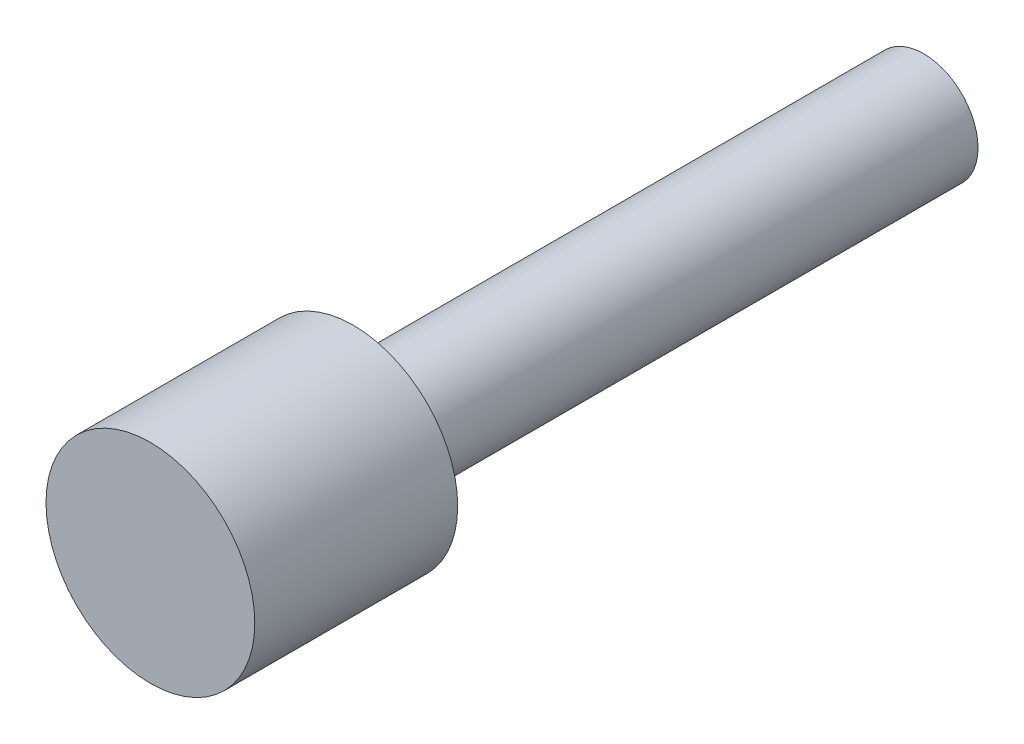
ISO-10303-21;
HEADER;
FILE_DESCRIPTION(('STEP AP214'),'2;1');
FILE_NAME('part.step','',(''),(''),'','','');
FILE_SCHEMA(('AUTOMOTIVE_DESIGN { 1 0 10303 214 1 1 1 1 }'));
ENDSEC;
DATA;
#1=APPLICATION_CONTEXT('core data for automotive mechanical design processes');
#2=APPLICATION_PROTOCOL_DEFINITION('international standard','automotive_design',2000,#1);
#3=PRODUCT_CONTEXT('',#1,'mechanical');
#4=PRODUCT('Part','Part','',(#3));
#5=PRODUCT_RELATED_PRODUCT_CATEGORY('part','',(#4));
#6=PRODUCT_DEFINITION_FORMATION('','',#4);
#7=PRODUCT_DEFINITION_CONTEXT('part definition',#1,'design');
#8=PRODUCT_DEFINITION('design','',#6,#7);
#9=PRODUCT_DEFINITION_SHAPE('','',#8);
#10=(LENGTH_UNIT() NAMED_UNIT(*) SI_UNIT(.MILLI.,.METRE.));
#11=(NAMED_UNIT(*) PLANE_ANGLE_UNIT() SI_UNIT($,.RADIAN.));
#12=(NAMED_UNIT(*) SI_UNIT($,.STERADIAN.) SOLID_ANGLE_UNIT());
#13=UNCERTAINTY_MEASURE_WITH_UNIT(LENGTH_MEASURE(1.E-05),#10,'distance_accuracy_value','');
#14=(GEOMETRIC_REPRESENTATION_CONTEXT(3) GLOBAL_UNCERTAINTY_ASSIGNED_CONTEXT((#13)) GLOBAL_UNIT_ASSIGNED_CONTEXT((#10,
#11,#12)) REPRESENTATION_CONTEXT('',''));
#15=CARTESIAN_POINT('',(0.,0.,0.));
#16=DIRECTION('',(0.,0.,1.));
#17=DIRECTION('',(1.,0.,0.));
#18=AXIS2_PLACEMENT_3D('',#15,#16,#17);
#19=CARTESIAN_POINT('',(0.,0.,-8.33119862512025));
#20=DIRECTION('',(0.,0.,1.));
#21=DIRECTION('',(1.,0.,0.));
#22=AXIS2_PLACEMENT_3D('',#19,#20,#21);
#23=CYLINDRICAL_SURFACE('',#22,4.28625);
#24=CARTESIAN_POINT('',(0.,0.,-8.33119862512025));
#25=DIRECTION('',(0.,0.,1.));
#26=DIRECTION('',(1.,0.,0.));
#27=AXIS2_PLACEMENT_3D('',#24,#25,#26);
#28=CIRCLE('',#27,4.28625);
#29=CARTESIAN_POINT('',(4.28625,0.,-8.33119862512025));
#30=VERTEX_POINT('',#29);
#31=EDGE_CURVE('E41',#30,#30,#28,.T.);
#32=ORIENTED_EDGE('',*,*,#31,.T.);
#33=EDGE_LOOP('',(#32));
#34=FACE_BOUND('',#33,.T.);
#35=CARTESIAN_POINT('',(0.,0.,0.));
#36=DIRECTION('',(0.,0.,1.));
#37=DIRECTION('',(1.,0.,0.));
#38=AXIS2_PLACEMENT_3D('',#35,#36,#37);
#39=CIRCLE('',#38,4.28625);
#40=CARTESIAN_POINT('',(4.28625,0.,0.));
#41=VERTEX_POINT('',#40);
#42=EDGE_CURVE('E37',#41,#41,#39,.T.);
#43=ORIENTED_EDGE('',*,*,#42,.F.);
#44=EDGE_LOOP('',(#43));
#45=FACE_BOUND('',#44,.T.);
#46=ADVANCED_FACE('F34',(#34,#45),#23,.T.);
#47=CARTESIAN_POINT('',(0.,0.,-8.33119862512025));
#48=DIRECTION('',(0.,0.,1.));
#49=DIRECTION('',(1.,0.,0.));
#50=AXIS2_PLACEMENT_3D('',#47,#48,#49);
#51=PLANE('',#50);
#52=CARTESIAN_POINT('',(0.,0.,-8.33119862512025));
#53=DIRECTION('',(0.,0.,-1.));
#54=DIRECTION('',(-1.,0.,0.));
#55=AXIS2_PLACEMENT_3D('',#52,#53,#54);
#56=CIRCLE('',#55,2.23266);
#57=CARTESIAN_POINT('',(2.23266,0.,-8.33119862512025));
#58=VERTEX_POINT('',#57);
#59=EDGE_CURVE('E10',#58,#58,#56,.T.);
#60=ORIENTED_EDGE('',*,*,#59,.F.);
#61=EDGE_LOOP('',(#60));
#62=FACE_BOUND('',#61,.T.);
#63=ORIENTED_EDGE('',*,*,#31,.F.);
#64=EDGE_LOOP('',(#63));
#65=FACE_BOUND('',#64,.T.);
#66=ADVANCED_FACE('F57',(#62,#65),#51,.F.);
#67=CARTESIAN_POINT('',(0.,0.,0.));
#68=DIRECTION('',(0.,0.,1.));
#69=DIRECTION('',(1.,0.,0.));
#70=AXIS2_PLACEMENT_3D('',#67,#68,#69);
#71=PLANE('',#70);
#72=ORIENTED_EDGE('',*,*,#42,.T.);
#73=EDGE_LOOP('',(#72));
#74=FACE_BOUND('',#73,.T.);
#75=ADVANCED_FACE('F54',(#74),#71,.T.);
#76=CARTESIAN_POINT('',(0.,0.,-38.0649161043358));
#77=DIRECTION('',(0.,0.,1.));
#78=DIRECTION('',(1.,0.,0.));
#79=AXIS2_PLACEMENT_3D('',#76,#77,#78);
#80=CYLINDRICAL_SURFACE('',#79,2.23266);
#81=CARTESIAN_POINT('',(0.,0.,-31.75));
#82=DIRECTION('',(0.,0.,-1.));
#83=DIRECTION('',(-1.,0.,0.));
#84=AXIS2_PLACEMENT_3D('',#81,#82,#83);
#85=CIRCLE('',#84,2.23266);
#86=CARTESIAN_POINT('',(2.23266,0.,-31.75));
#87=VERTEX_POINT('',#86);
#88=EDGE_CURVE('E47',#87,#87,#85,.T.);
#89=CARTESIAN_POINT('',(2.23266,0.,-8.33119862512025));
#90=CARTESIAN_POINT('',(2.23266,0.,-8.57514447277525));
#91=CARTESIAN_POINT('',(2.23266,0.,-8.81909032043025));
#92=CARTESIAN_POINT('',(2.23266,0.,-9.30698201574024));
#93=CARTESIAN_POINT('',(2.23266,0.,-9.55092786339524));
#94=CARTESIAN_POINT('',(2.23266,0.,-10.0388195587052));
#95=CARTESIAN_POINT('',(2.23266,0.,-10.2827654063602));
#96=CARTESIAN_POINT('',(2.23266,0.,-10.7706571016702));
#97=CARTESIAN_POINT('',(2.23266,0.,-11.0146029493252));
#98=CARTESIAN_POINT('',(2.23266,0.,-11.5024946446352));
#99=CARTESIAN_POINT('',(2.23266,0.,-11.7464404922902));
#100=CARTESIAN_POINT('',(2.23266,0.,-12.2343321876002));
#101=CARTESIAN_POINT('',(2.23266,0.,-12.4782780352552));
#102=CARTESIAN_POINT('',(2.23266,0.,-12.9661697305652));
#103=CARTESIAN_POINT('',(2.23266,0.,-13.2101155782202));
#104=CARTESIAN_POINT('',(2.23266,0.,-13.6980072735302));
#105=CARTESIAN_POINT('',(2.23266,0.,-13.9419531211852));
#106=CARTESIAN_POINT('',(2.23266,0.,-14.4298448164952));
#107=CARTESIAN_POINT('',(2.23266,0.,-14.6737906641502));
#108=CARTESIAN_POINT('',(2.23266,0.,-15.1616823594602));
#109=CARTESIAN_POINT('',(2.23266,0.,-15.4056282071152));
#110=CARTESIAN_POINT('',(2.23266,0.,-15.8935199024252));
#111=CARTESIAN_POINT('',(2.23266,0.,-16.1374657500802));
#112=CARTESIAN_POINT('',(2.23266,0.,-16.6253574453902));
#113=CARTESIAN_POINT('',(2.23266,0.,-16.8693032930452));
#114=CARTESIAN_POINT('',(2.23266,0.,-17.3571949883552));
#115=CARTESIAN_POINT('',(2.23266,0.,-17.6011408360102));
#116=CARTESIAN_POINT('',(2.23266,0.,-18.0890325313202));
#117=CARTESIAN_POINT('',(2.23266,0.,-18.3329783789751));
#118=CARTESIAN_POINT('',(2.23266,0.,-18.8208700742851));
#119=CARTESIAN_POINT('',(2.23266,0.,-19.0648159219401));
#120=CARTESIAN_POINT('',(2.23266,0.,-19.5527076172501));
#121=CARTESIAN_POINT('',(2.23266,0.,-19.7966534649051));
#122=CARTESIAN_POINT('',(2.23266,0.,-20.2845451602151));
#123=CARTESIAN_POINT('',(2.23266,0.,-20.5284910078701));
#124=CARTESIAN_POINT('',(2.23266,0.,-21.0163827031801));
#125=CARTESIAN_POINT('',(2.23266,0.,-21.2603285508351));
#126=CARTESIAN_POINT('',(2.23266,0.,-21.7482202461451));
#127=CARTESIAN_POINT('',(2.23266,0.,-21.9921660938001));
#128=CARTESIAN_POINT('',(2.23266,0.,-22.4800577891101));
#129=CARTESIAN_POINT('',(2.23266,0.,-22.7240036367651));
#130=CARTESIAN_POINT('',(2.23266,0.,-23.2118953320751));
#131=CARTESIAN_POINT('',(2.23266,0.,-23.4558411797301));
#132=CARTESIAN_POINT('',(2.23266,0.,-23.9437328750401));
#133=CARTESIAN_POINT('',(2.23266,0.,-24.1876787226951));
#134=CARTESIAN_POINT('',(2.23266,0.,-24.6755704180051));
#135=CARTESIAN_POINT('',(2.23266,0.,-24.9195162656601));
#136=CARTESIAN_POINT('',(2.23266,0.,-25.4074079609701));
#137=CARTESIAN_POINT('',(2.23266,0.,-25.6513538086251));
#138=CARTESIAN_POINT('',(2.23266,0.,-26.1392455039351));
#139=CARTESIAN_POINT('',(2.23266,0.,-26.3831913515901));
#140=CARTESIAN_POINT('',(2.23266,0.,-26.8710830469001));
#141=CARTESIAN_POINT('',(2.23266,0.,-27.115028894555));
#142=CARTESIAN_POINT('',(2.23266,0.,-27.602920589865));
#143=CARTESIAN_POINT('',(2.23266,0.,-27.84686643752));
#144=CARTESIAN_POINT('',(2.23266,0.,-28.33475813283));
#145=CARTESIAN_POINT('',(2.23266,0.,-28.578703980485));
#146=CARTESIAN_POINT('',(2.23266,0.,-29.066595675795));
#147=CARTESIAN_POINT('',(2.23266,0.,-29.31054152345));
#148=CARTESIAN_POINT('',(2.23266,0.,-29.79843321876));
#149=CARTESIAN_POINT('',(2.23266,0.,-30.042379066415));
#150=CARTESIAN_POINT('',(2.23266,0.,-30.530270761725));
#151=CARTESIAN_POINT('',(2.23266,0.,-30.77421660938));
#152=CARTESIAN_POINT('',(2.23266,0.,-31.26210830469));
#153=CARTESIAN_POINT('',(2.23266,0.,-31.506054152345));
#154=CARTESIAN_POINT('',(2.23266,0.,-31.75));
#155=B_SPLINE_CURVE_WITH_KNOTS('',3,(#89,#90,#91,#92,#93,#94,#95,#96,#97,#98,#99,#100,#101,#102,
#103,#104,#105,#106,#107,#108,#109,#110,#111,#112,#113,#114,#115,#116,#117,#118,#119,#120,#121,
#122,#123,#124,#125,#126,#127,#128,#129,#130,#131,#132,#133,#134,#135,#136,#137,#138,#139,#140,
#141,#142,#143,#144,#145,#146,#147,#148,#149,#150,#151,#152,#153,#154),.UNSPECIFIED.,.F.,.F.,(4,
2,2,2,2,2,2,2,2,2,2,2,2,2,2,2,2,2,2,2,2,2,2,2,2,2,2,2,2,2,2,2,4),(0.,0.731837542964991,
1.46367508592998,2.19551262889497,2.92735017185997,3.65918771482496,4.39102525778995,
5.12286280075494,5.85470034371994,6.58653788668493,7.31837542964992,8.05021297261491,
8.7820505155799,9.5138880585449,10.2457256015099,10.9775631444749,11.7094006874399,
12.4412382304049,13.1730757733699,13.9049133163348,14.6367508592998,15.3685884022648,
16.1004259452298,16.8322634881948,17.5641010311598,18.2959385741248,19.0277761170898,
19.7596136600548,20.4914512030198,21.2232887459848,21.9551262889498,22.6869638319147,
23.4188013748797),.UNSPECIFIED.);
#156=EDGE_CURVE('BSEAM69',#58,#87,#155,.T.);
#157=ORIENTED_EDGE('',*,*,#59,.T.);
#158=ORIENTED_EDGE('',*,*,#88,.F.);
#159=ORIENTED_EDGE('',*,*,#156,.T.);
#160=ORIENTED_EDGE('',*,*,#156,.F.);
#161=EDGE_LOOP('',(#157,#159,#158,#160));
#162=FACE_BOUND('',#161,.T.);
#163=ADVANCED_FACE('F69',(#162),#80,.T.);
#164=CARTESIAN_POINT('',(0.,0.,-31.75));
#165=DIRECTION('',(0.,0.,-1.));
#166=DIRECTION('',(-1.,0.,0.));
#167=AXIS2_PLACEMENT_3D('',#164,#165,#166);
#168=PLANE('',#167);
#169=ORIENTED_EDGE('',*,*,#88,.T.);
#170=EDGE_LOOP('',(#169));
#171=FACE_BOUND('',#170,.T.);
#172=ADVANCED_FACE('F71',(#171),#168,.T.);
#173=CLOSED_SHELL('',(#46,#66,#75,#163,#172));
#174=MANIFOLD_SOLID_BREP('B2',#173);
#175=ADVANCED_BREP_SHAPE_REPRESENTATION('',(#18,#174),#14);
#176=SHAPE_DEFINITION_REPRESENTATION(#9,#175);
ENDSEC;
END-ISO-10303-21;
